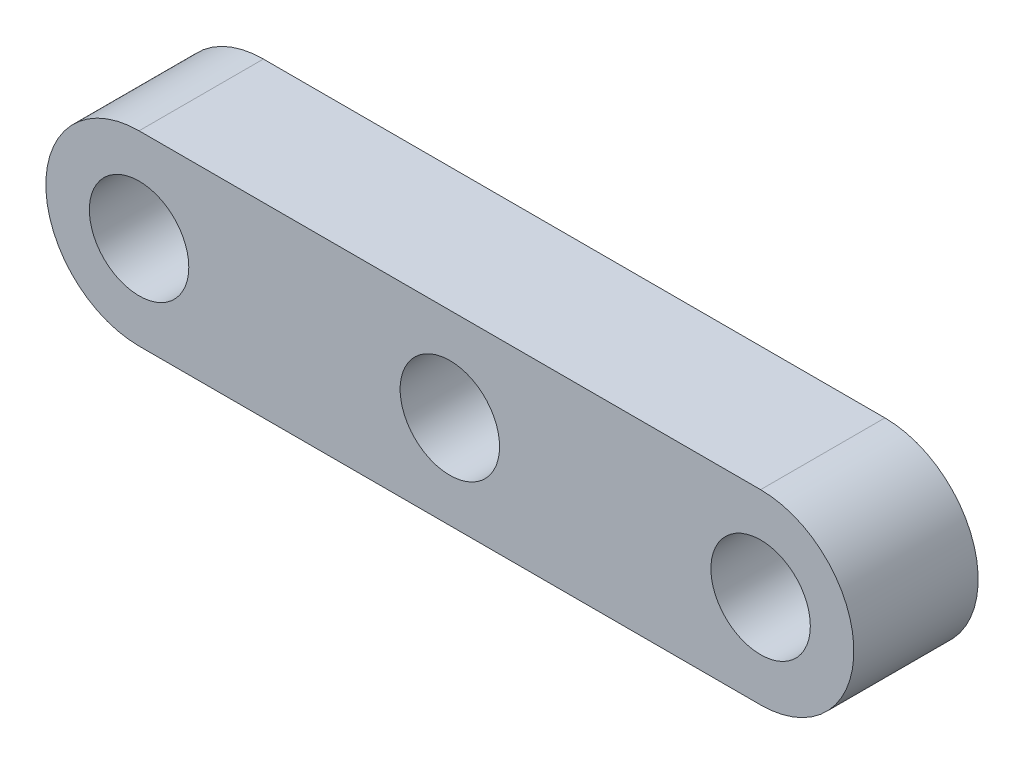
from build123d import *

# Parameters (mm, degrees)
SKETCH_1_R      = 1.6
EXTRUDE_1_DEPTH = 2


with BuildPart() as part:
    # Sketch 1 → Extrude 1 (new, symmetric)
    with BuildSketch(Plane.XY):
        with BuildLine():
            Line((0, 3), (20, 3))
            ThreePointArc((20, 3), (23, 0), (20, -3))
            Line((20, -3), (0, -3))
            ThreePointArc((0, -3), (-3, 0), (0, 3))
        make_face()
        Circle(SKETCH_1_R, mode=Mode.SUBTRACT)
        with Locations((10, 0)):
            Circle(SKETCH_1_R, mode=Mode.SUBTRACT)
        with Locations((20, 0)):
            Circle(SKETCH_1_R, mode=Mode.SUBTRACT)
    extrude(amount=EXTRUDE_1_DEPTH, both=True)


solid = part.part
